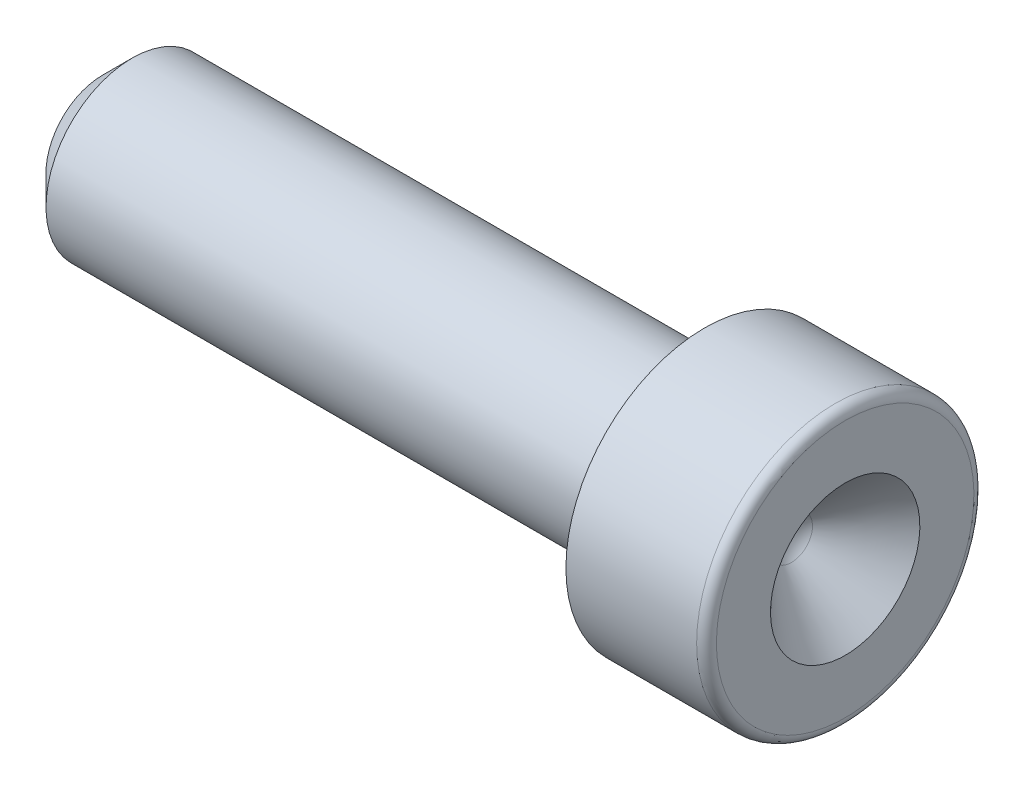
from build123d import *


with BuildPart() as part:
    # Sketch1 → Revolve1 (revolve)
    with BuildSketch(Plane.XY):
        with BuildLine():
            Line((14.9352, 0), (0.762, 0))
            Line((0.762, 0), (0, -0.762))
            Line((0, -0.762), (0, -2.2098))
            Line((0, -2.2098), (17.4498, -2.2098))
            ThreePointArc((17.4498, -2.2098), (17.507803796, -1.918195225), (17.672984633, -1.670984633))
            Line((17.672984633, -1.670984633), (19.05, -0.293969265))
            Line((19.05, -0.293969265), (19.05, 1.0922))
            ThreePointArc((19.05, 1.0922), (18.975605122, 1.271805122), (18.796, 1.3462))
            Line((18.796, 1.3462), (15.4432, 1.3462))
            Line((15.4432, 1.3462), (15.4432, 0.508))
            ThreePointArc((15.4432, 0.508), (15.294410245, 0.148789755), (14.9352, 0))
        make_face()
    revolve(axis=Axis((79.827832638, -2.2098, 0), (-1, 0, 0)))


solid = part.part
